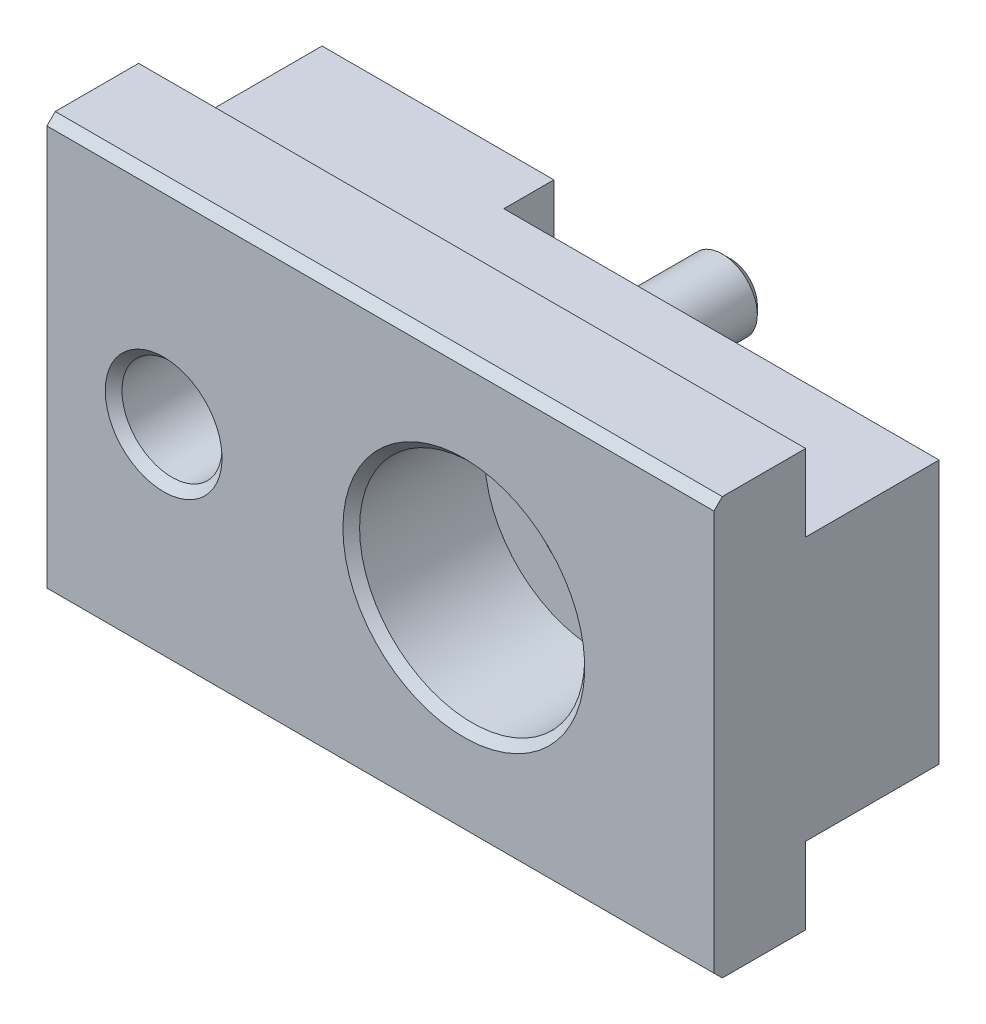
ISO-10303-21;
HEADER;
FILE_DESCRIPTION(('STEP AP214'),'2;1');
FILE_NAME('part.step','',(''),(''),'','','');
FILE_SCHEMA(('AUTOMOTIVE_DESIGN { 1 0 10303 214 1 1 1 1 }'));
ENDSEC;
DATA;
#1=APPLICATION_CONTEXT('core data for automotive mechanical design processes');
#2=APPLICATION_PROTOCOL_DEFINITION('international standard','automotive_design',2000,#1);
#3=PRODUCT_CONTEXT('',#1,'mechanical');
#4=PRODUCT('Part','Part','',(#3));
#5=PRODUCT_RELATED_PRODUCT_CATEGORY('part','',(#4));
#6=PRODUCT_DEFINITION_FORMATION('','',#4);
#7=PRODUCT_DEFINITION_CONTEXT('part definition',#1,'design');
#8=PRODUCT_DEFINITION('design','',#6,#7);
#9=PRODUCT_DEFINITION_SHAPE('','',#8);
#10=(LENGTH_UNIT() NAMED_UNIT(*) SI_UNIT(.MILLI.,.METRE.));
#11=(NAMED_UNIT(*) PLANE_ANGLE_UNIT() SI_UNIT($,.RADIAN.));
#12=(NAMED_UNIT(*) SI_UNIT($,.STERADIAN.) SOLID_ANGLE_UNIT());
#13=UNCERTAINTY_MEASURE_WITH_UNIT(LENGTH_MEASURE(1.E-05),#10,'distance_accuracy_value','');
#14=(GEOMETRIC_REPRESENTATION_CONTEXT(3) GLOBAL_UNCERTAINTY_ASSIGNED_CONTEXT((#13)) GLOBAL_UNIT_ASSIGNED_CONTEXT((#10,
#11,#12)) REPRESENTATION_CONTEXT('',''));
#15=CARTESIAN_POINT('',(0.,0.,0.));
#16=DIRECTION('',(0.,0.,1.));
#17=DIRECTION('',(1.,0.,0.));
#18=AXIS2_PLACEMENT_3D('',#15,#16,#17);
#19=CARTESIAN_POINT('',(18.,0.,5.5));
#20=DIRECTION('',(0.,0.,-1.));
#21=DIRECTION('',(-1.,0.,0.));
#22=AXIS2_PLACEMENT_3D('',#19,#20,#21);
#23=CYLINDRICAL_SURFACE('',#22,4.1);
#24=CARTESIAN_POINT('',(18.,0.,-7.5));
#25=DIRECTION('',(0.,0.,1.));
#26=DIRECTION('',(1.,0.,0.));
#27=AXIS2_PLACEMENT_3D('',#24,#25,#26);
#28=CIRCLE('',#27,4.1);
#29=CARTESIAN_POINT('',(22.1,0.,-7.5));
#30=VERTEX_POINT('',#29);
#31=EDGE_CURVE('E222',#30,#30,#28,.F.);
#32=ORIENTED_EDGE('',*,*,#31,.T.);
#33=EDGE_LOOP('',(#32));
#34=FACE_BOUND('',#33,.T.);
#35=CARTESIAN_POINT('',(18.,0.,-2.5));
#36=DIRECTION('',(0.,0.,1.));
#37=DIRECTION('',(1.,0.,0.));
#38=AXIS2_PLACEMENT_3D('',#35,#36,#37);
#39=CIRCLE('',#38,4.1);
#40=CARTESIAN_POINT('',(22.1,0.,-2.5));
#41=VERTEX_POINT('',#40);
#42=EDGE_CURVE('E150',#41,#41,#39,.F.);
#43=ORIENTED_EDGE('',*,*,#42,.F.);
#44=EDGE_LOOP('',(#43));
#45=FACE_BOUND('',#44,.T.);
#46=ADVANCED_FACE('F14',(#34,#45),#23,.F.);
#47=CARTESIAN_POINT('',(7.,-7.95,-11.));
#48=DIRECTION('',(0.,0.,1.));
#49=DIRECTION('',(1.,0.,0.));
#50=AXIS2_PLACEMENT_3D('',#47,#48,#49);
#51=PLANE('',#50);
#52=CARTESIAN_POINT('',(0.,0.,-11.));
#53=DIRECTION('',(0.,0.,1.));
#54=DIRECTION('',(1.,0.,0.));
#55=AXIS2_PLACEMENT_3D('',#52,#53,#54);
#56=CIRCLE('',#55,3.5);
#57=CARTESIAN_POINT('',(3.5,0.,-11.));
#58=VERTEX_POINT('',#57);
#59=EDGE_CURVE('E219',#58,#58,#56,.T.);
#60=ORIENTED_EDGE('',*,*,#59,.T.);
#61=EDGE_LOOP('',(#60));
#62=FACE_BOUND('',#61,.T.);
#63=DIRECTION('',(0.,-1.,0.));
#64=VECTOR('',#63,1.);
#65=CARTESIAN_POINT('',(6.9,-7.95,-11.));
#66=LINE('',#65,#64);
#67=CARTESIAN_POINT('',(6.9,7.9,-11.));
#68=VERTEX_POINT('',#67);
#69=CARTESIAN_POINT('',(6.9,-7.9,-11.));
#70=VERTEX_POINT('',#69);
#71=EDGE_CURVE('E152',#68,#70,#66,.T.);
#72=ORIENTED_EDGE('',*,*,#71,.T.);
#73=DIRECTION('',(-1.,0.,0.));
#74=VECTOR('',#73,1.);
#75=CARTESIAN_POINT('',(7.,-7.9,-11.));
#76=LINE('',#75,#74);
#77=CARTESIAN_POINT('',(-7.,-7.9,-11.));
#78=VERTEX_POINT('',#77);
#79=EDGE_CURVE('E29',#70,#78,#76,.T.);
#80=ORIENTED_EDGE('',*,*,#79,.T.);
#81=DIRECTION('',(0.,-1.,0.));
#82=VECTOR('',#81,1.);
#83=CARTESIAN_POINT('',(-7.,-7.95,-11.));
#84=LINE('',#83,#82);
#85=CARTESIAN_POINT('',(-7.,7.9,-11.));
#86=VERTEX_POINT('',#85);
#87=EDGE_CURVE('E115',#86,#78,#84,.T.);
#88=ORIENTED_EDGE('',*,*,#87,.F.);
#89=DIRECTION('',(1.,0.,0.));
#90=VECTOR('',#89,1.);
#91=CARTESIAN_POINT('',(7.,7.9,-11.));
#92=LINE('',#91,#90);
#93=EDGE_CURVE('E144',#86,#68,#92,.T.);
#94=ORIENTED_EDGE('',*,*,#93,.T.);
#95=EDGE_LOOP('',(#72,#80,#88,#94));
#96=FACE_BOUND('',#95,.T.);
#97=ADVANCED_FACE('F244',(#62,#96),#51,.F.);
#98=CARTESIAN_POINT('',(7.,12.5,0.));
#99=DIRECTION('',(0.,-1.,0.));
#100=DIRECTION('',(1.,0.,0.));
#101=AXIS2_PLACEMENT_3D('',#98,#99,#100);
#102=PLANE('',#101);
#103=DIRECTION('',(1.,0.,0.));
#104=VECTOR('',#103,1.);
#105=CARTESIAN_POINT('',(7.,12.5,5.));
#106=LINE('',#105,#104);
#107=CARTESIAN_POINT('',(-7.,12.5,5.));
#108=VERTEX_POINT('',#107);
#109=CARTESIAN_POINT('',(33.,12.5,5.));
#110=VERTEX_POINT('',#109);
#111=EDGE_CURVE('E182',#108,#110,#106,.T.);
#112=ORIENTED_EDGE('',*,*,#111,.T.);
#113=DIRECTION('',(0.,0.,1.));
#114=VECTOR('',#113,1.);
#115=CARTESIAN_POINT('',(33.,12.5,-11.));
#116=LINE('',#115,#114);
#117=CARTESIAN_POINT('',(33.,12.5,0.));
#118=VERTEX_POINT('',#117);
#119=EDGE_CURVE('E180',#118,#110,#116,.T.);
#120=ORIENTED_EDGE('',*,*,#119,.F.);
#121=DIRECTION('',(1.,0.,0.));
#122=VECTOR('',#121,1.);
#123=CARTESIAN_POINT('',(7.,12.5,0.));
#124=LINE('',#123,#122);
#125=CARTESIAN_POINT('',(-7.,12.5,0.));
#126=VERTEX_POINT('',#125);
#127=EDGE_CURVE('E199',#118,#126,#124,.F.);
#128=ORIENTED_EDGE('',*,*,#127,.T.);
#129=DIRECTION('',(0.,0.,1.));
#130=VECTOR('',#129,1.);
#131=CARTESIAN_POINT('',(-7.,12.5,-11.));
#132=LINE('',#131,#130);
#133=EDGE_CURVE('E194',#108,#126,#132,.F.);
#134=ORIENTED_EDGE('',*,*,#133,.F.);
#135=EDGE_LOOP('',(#112,#120,#128,#134));
#136=FACE_BOUND('',#135,.T.);
#137=ADVANCED_FACE('F246',(#136),#102,.F.);
#138=CARTESIAN_POINT('',(7.,-12.5,0.));
#139=DIRECTION('',(0.,1.,0.));
#140=DIRECTION('',(-1.,0.,0.));
#141=AXIS2_PLACEMENT_3D('',#138,#139,#140);
#142=PLANE('',#141);
#143=DIRECTION('',(1.,0.,0.));
#144=VECTOR('',#143,1.);
#145=CARTESIAN_POINT('',(7.,-12.5,5.));
#146=LINE('',#145,#144);
#147=CARTESIAN_POINT('',(33.,-12.5,5.));
#148=VERTEX_POINT('',#147);
#149=CARTESIAN_POINT('',(-7.,-12.5,5.));
#150=VERTEX_POINT('',#149);
#151=EDGE_CURVE('E196',#148,#150,#146,.F.);
#152=ORIENTED_EDGE('',*,*,#151,.T.);
#153=DIRECTION('',(0.,0.,1.));
#154=VECTOR('',#153,1.);
#155=CARTESIAN_POINT('',(-7.,-12.5,-11.));
#156=LINE('',#155,#154);
#157=CARTESIAN_POINT('',(-7.,-12.5,0.));
#158=VERTEX_POINT('',#157);
#159=EDGE_CURVE('E114',#158,#150,#156,.T.);
#160=ORIENTED_EDGE('',*,*,#159,.F.);
#161=DIRECTION('',(1.,0.,0.));
#162=VECTOR('',#161,1.);
#163=CARTESIAN_POINT('',(7.,-12.5,0.));
#164=LINE('',#163,#162);
#165=CARTESIAN_POINT('',(33.,-12.5,0.));
#166=VERTEX_POINT('',#165);
#167=EDGE_CURVE('E110',#158,#166,#164,.T.);
#168=ORIENTED_EDGE('',*,*,#167,.T.);
#169=DIRECTION('',(0.,0.,1.));
#170=VECTOR('',#169,1.);
#171=CARTESIAN_POINT('',(33.,-12.5,-11.));
#172=LINE('',#171,#170);
#173=EDGE_CURVE('E173',#148,#166,#172,.F.);
#174=ORIENTED_EDGE('',*,*,#173,.F.);
#175=EDGE_LOOP('',(#152,#160,#168,#174));
#176=FACE_BOUND('',#175,.T.);
#177=ADVANCED_FACE('F256',(#176),#142,.F.);
#178=CARTESIAN_POINT('',(7.,-12.5,0.));
#179=DIRECTION('',(0.,0.,1.));
#180=DIRECTION('',(1.,0.,0.));
#181=AXIS2_PLACEMENT_3D('',#178,#179,#180);
#182=PLANE('',#181);
#183=ORIENTED_EDGE('',*,*,#167,.F.);
#184=DIRECTION('',(0.,-1.,0.));
#185=VECTOR('',#184,1.);
#186=CARTESIAN_POINT('',(-7.,-7.95,0.));
#187=LINE('',#186,#185);
#188=CARTESIAN_POINT('',(-7.,-7.9,0.));
#189=VERTEX_POINT('',#188);
#190=EDGE_CURVE('E104',#189,#158,#187,.T.);
#191=ORIENTED_EDGE('',*,*,#190,.F.);
#192=DIRECTION('',(-1.,0.,0.));
#193=VECTOR('',#192,1.);
#194=CARTESIAN_POINT('',(46.058386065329,-7.9,0.));
#195=LINE('',#194,#193);
#196=CARTESIAN_POINT('',(33.,-7.9,0.));
#197=VERTEX_POINT('',#196);
#198=EDGE_CURVE('E108',#197,#189,#195,.T.);
#199=ORIENTED_EDGE('',*,*,#198,.F.);
#200=DIRECTION('',(0.,1.,0.));
#201=VECTOR('',#200,1.);
#202=CARTESIAN_POINT('',(33.,-7.95,0.));
#203=LINE('',#202,#201);
#204=EDGE_CURVE('E171',#166,#197,#203,.T.);
#205=ORIENTED_EDGE('',*,*,#204,.F.);
#206=EDGE_LOOP('',(#183,#191,#199,#205));
#207=FACE_BOUND('',#206,.T.);
#208=ADVANCED_FACE('F106',(#207),#182,.F.);
#209=CARTESIAN_POINT('',(33.,-7.95,-8.));
#210=DIRECTION('',(0.,0.,1.));
#211=DIRECTION('',(1.,0.,0.));
#212=AXIS2_PLACEMENT_3D('',#209,#210,#211);
#213=PLANE('',#212);
#214=CARTESIAN_POINT('',(18.,0.,-8.));
#215=DIRECTION('',(0.,0.,1.));
#216=DIRECTION('',(1.,0.,0.));
#217=AXIS2_PLACEMENT_3D('',#214,#215,#216);
#218=CIRCLE('',#217,4.6);
#219=CARTESIAN_POINT('',(22.6,0.,-8.));
#220=VERTEX_POINT('',#219);
#221=EDGE_CURVE('E225',#220,#220,#218,.T.);
#222=ORIENTED_EDGE('',*,*,#221,.T.);
#223=EDGE_LOOP('',(#222));
#224=FACE_BOUND('',#223,.T.);
#225=CARTESIAN_POINT('',(10.,0.,-8.));
#226=DIRECTION('',(0.,0.,1.));
#227=DIRECTION('',(1.,0.,0.));
#228=AXIS2_PLACEMENT_3D('',#225,#226,#227);
#229=CIRCLE('',#228,2.1);
#230=CARTESIAN_POINT('',(12.1,0.,-8.));
#231=VERTEX_POINT('',#230);
#232=EDGE_CURVE('E157',#231,#231,#229,.F.);
#233=ORIENTED_EDGE('',*,*,#232,.F.);
#234=EDGE_LOOP('',(#233));
#235=FACE_BOUND('',#234,.T.);
#236=DIRECTION('',(0.,1.,0.));
#237=VECTOR('',#236,1.);
#238=CARTESIAN_POINT('',(33.,-7.95,-8.));
#239=LINE('',#238,#237);
#240=CARTESIAN_POINT('',(33.,-7.9,-8.));
#241=VERTEX_POINT('',#240);
#242=CARTESIAN_POINT('',(33.,7.9,-8.));
#243=VERTEX_POINT('',#242);
#244=EDGE_CURVE('E169',#241,#243,#239,.T.);
#245=ORIENTED_EDGE('',*,*,#244,.F.);
#246=DIRECTION('',(-1.,0.,0.));
#247=VECTOR('',#246,1.);
#248=CARTESIAN_POINT('',(33.,-7.9,-8.));
#249=LINE('',#248,#247);
#250=CARTESIAN_POINT('',(6.9,-7.9,-8.));
#251=VERTEX_POINT('',#250);
#252=EDGE_CURVE('E122',#241,#251,#249,.T.);
#253=ORIENTED_EDGE('',*,*,#252,.T.);
#254=DIRECTION('',(0.,1.,0.));
#255=VECTOR('',#254,1.);
#256=CARTESIAN_POINT('',(6.9,-17.6703763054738,-8.));
#257=LINE('',#256,#255);
#258=CARTESIAN_POINT('',(6.9,7.9,-8.));
#259=VERTEX_POINT('',#258);
#260=EDGE_CURVE('E36',#251,#259,#257,.T.);
#261=ORIENTED_EDGE('',*,*,#260,.T.);
#262=DIRECTION('',(1.,0.,0.));
#263=VECTOR('',#262,1.);
#264=CARTESIAN_POINT('',(33.,7.9,-8.));
#265=LINE('',#264,#263);
#266=EDGE_CURVE('E142',#259,#243,#265,.T.);
#267=ORIENTED_EDGE('',*,*,#266,.T.);
#268=EDGE_LOOP('',(#245,#253,#261,#267));
#269=FACE_BOUND('',#268,.T.);
#270=ADVANCED_FACE('F295',(#224,#235,#269),#213,.F.);
#271=CARTESIAN_POINT('',(7.,7.95,0.));
#272=DIRECTION('',(0.,0.,1.));
#273=DIRECTION('',(1.,0.,0.));
#274=AXIS2_PLACEMENT_3D('',#271,#272,#273);
#275=PLANE('',#274);
#276=ORIENTED_EDGE('',*,*,#127,.F.);
#277=DIRECTION('',(0.,1.,0.));
#278=VECTOR('',#277,1.);
#279=CARTESIAN_POINT('',(33.,-7.95,0.));
#280=LINE('',#279,#278);
#281=CARTESIAN_POINT('',(33.,7.9,0.));
#282=VERTEX_POINT('',#281);
#283=EDGE_CURVE('E167',#282,#118,#280,.T.);
#284=ORIENTED_EDGE('',*,*,#283,.F.);
#285=DIRECTION('',(-1.,0.,0.));
#286=VECTOR('',#285,1.);
#287=CARTESIAN_POINT('',(46.058386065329,7.9,0.));
#288=LINE('',#287,#286);
#289=CARTESIAN_POINT('',(-7.,7.9,0.));
#290=VERTEX_POINT('',#289);
#291=EDGE_CURVE('E139',#282,#290,#288,.T.);
#292=ORIENTED_EDGE('',*,*,#291,.T.);
#293=DIRECTION('',(0.,-1.,0.));
#294=VECTOR('',#293,1.);
#295=CARTESIAN_POINT('',(-7.,-7.95,0.));
#296=LINE('',#295,#294);
#297=EDGE_CURVE('E192',#126,#290,#296,.T.);
#298=ORIENTED_EDGE('',*,*,#297,.F.);
#299=EDGE_LOOP('',(#276,#284,#292,#298));
#300=FACE_BOUND('',#299,.T.);
#301=ADVANCED_FACE('F291',(#300),#275,.F.);
#302=CARTESIAN_POINT('',(7.,-12.5,5.));
#303=DIRECTION('',(0.,0.707106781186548,-0.707106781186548));
#304=DIRECTION('',(0.,0.707106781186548,0.707106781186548));
#305=AXIS2_PLACEMENT_3D('',#302,#303,#304);
#306=PLANE('',#305);
#307=DIRECTION('',(-1.,0.,0.));
#308=VECTOR('',#307,1.);
#309=CARTESIAN_POINT('',(7.,-12.,5.5));
#310=LINE('',#309,#308);
#311=CARTESIAN_POINT('',(33.,-12.,5.5));
#312=VERTEX_POINT('',#311);
#313=CARTESIAN_POINT('',(-7.,-12.,5.5));
#314=VERTEX_POINT('',#313);
#315=EDGE_CURVE('E164',#312,#314,#310,.T.);
#316=ORIENTED_EDGE('',*,*,#315,.T.);
#317=DIRECTION('',(0.,0.707106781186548,0.707106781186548));
#318=VECTOR('',#317,1.);
#319=CARTESIAN_POINT('',(-7.,-12.5,5.));
#320=LINE('',#319,#318);
#321=EDGE_CURVE('E188',#150,#314,#320,.T.);
#322=ORIENTED_EDGE('',*,*,#321,.F.);
#323=ORIENTED_EDGE('',*,*,#151,.F.);
#324=DIRECTION('',(0.,-0.707106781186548,-0.707106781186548));
#325=VECTOR('',#324,1.);
#326=CARTESIAN_POINT('',(33.,-12.,5.5));
#327=LINE('',#326,#325);
#328=EDGE_CURVE('E175',#312,#148,#327,.T.);
#329=ORIENTED_EDGE('',*,*,#328,.F.);
#330=EDGE_LOOP('',(#316,#322,#323,#329));
#331=FACE_BOUND('',#330,.T.);
#332=ADVANCED_FACE('F288',(#331),#306,.F.);
#333=CARTESIAN_POINT('',(-7.,-7.95,-11.));
#334=DIRECTION('',(-1.,0.,0.));
#335=DIRECTION('',(0.,-1.,0.));
#336=AXIS2_PLACEMENT_3D('',#333,#334,#335);
#337=PLANE('',#336);
#338=DIRECTION('',(0.,0.,-1.));
#339=VECTOR('',#338,1.);
#340=CARTESIAN_POINT('',(-7.,-7.9,0.));
#341=LINE('',#340,#339);
#342=EDGE_CURVE('E119',#189,#78,#341,.T.);
#343=ORIENTED_EDGE('',*,*,#342,.F.);
#344=ORIENTED_EDGE('',*,*,#190,.T.);
#345=ORIENTED_EDGE('',*,*,#159,.T.);
#346=ORIENTED_EDGE('',*,*,#321,.T.);
#347=DIRECTION('',(0.,1.,0.));
#348=VECTOR('',#347,1.);
#349=CARTESIAN_POINT('',(-7.,-12.5,5.5));
#350=LINE('',#349,#348);
#351=CARTESIAN_POINT('',(-7.,12.,5.5));
#352=VERTEX_POINT('',#351);
#353=EDGE_CURVE('E161',#314,#352,#350,.T.);
#354=ORIENTED_EDGE('',*,*,#353,.T.);
#355=DIRECTION('',(0.,0.707106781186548,-0.707106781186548));
#356=VECTOR('',#355,1.);
#357=CARTESIAN_POINT('',(-7.,12.,5.5));
#358=LINE('',#357,#356);
#359=EDGE_CURVE('E185',#352,#108,#358,.T.);
#360=ORIENTED_EDGE('',*,*,#359,.T.);
#361=ORIENTED_EDGE('',*,*,#133,.T.);
#362=ORIENTED_EDGE('',*,*,#297,.T.);
#363=DIRECTION('',(0.,0.,1.));
#364=VECTOR('',#363,1.);
#365=CARTESIAN_POINT('',(-7.,7.9,0.));
#366=LINE('',#365,#364);
#367=EDGE_CURVE('E133',#86,#290,#366,.T.);
#368=ORIENTED_EDGE('',*,*,#367,.F.);
#369=ORIENTED_EDGE('',*,*,#87,.T.);
#370=EDGE_LOOP('',(#343,#344,#345,#346,#354,#360,#361,#362,#368,#369));
#371=FACE_BOUND('',#370,.T.);
#372=ADVANCED_FACE('F125',(#371),#337,.T.);
#373=CARTESIAN_POINT('',(7.,12.,5.5));
#374=DIRECTION('',(0.,-0.707106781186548,-0.707106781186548));
#375=DIRECTION('',(0.,0.707106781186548,-0.707106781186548));
#376=AXIS2_PLACEMENT_3D('',#373,#374,#375);
#377=PLANE('',#376);
#378=ORIENTED_EDGE('',*,*,#111,.F.);
#379=ORIENTED_EDGE('',*,*,#359,.F.);
#380=DIRECTION('',(-1.,0.,0.));
#381=VECTOR('',#380,1.);
#382=CARTESIAN_POINT('',(7.,12.,5.5));
#383=LINE('',#382,#381);
#384=CARTESIAN_POINT('',(33.,12.,5.5));
#385=VERTEX_POINT('',#384);
#386=EDGE_CURVE('E158',#352,#385,#383,.F.);
#387=ORIENTED_EDGE('',*,*,#386,.T.);
#388=DIRECTION('',(0.,-0.707106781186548,0.707106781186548));
#389=VECTOR('',#388,1.);
#390=CARTESIAN_POINT('',(33.,12.5,5.));
#391=LINE('',#390,#389);
#392=EDGE_CURVE('E178',#110,#385,#391,.T.);
#393=ORIENTED_EDGE('',*,*,#392,.F.);
#394=EDGE_LOOP('',(#378,#379,#387,#393));
#395=FACE_BOUND('',#394,.T.);
#396=ADVANCED_FACE('F281',(#395),#377,.F.);
#397=CARTESIAN_POINT('',(33.,-7.95,-11.));
#398=DIRECTION('',(1.,0.,0.));
#399=DIRECTION('',(0.,1.,0.));
#400=AXIS2_PLACEMENT_3D('',#397,#398,#399);
#401=PLANE('',#400);
#402=DIRECTION('',(0.,0.,-1.));
#403=VECTOR('',#402,1.);
#404=CARTESIAN_POINT('',(33.,-7.9,0.));
#405=LINE('',#404,#403);
#406=EDGE_CURVE('E121',#197,#241,#405,.T.);
#407=ORIENTED_EDGE('',*,*,#406,.T.);
#408=ORIENTED_EDGE('',*,*,#244,.T.);
#409=DIRECTION('',(0.,0.,1.));
#410=VECTOR('',#409,1.);
#411=CARTESIAN_POINT('',(33.,7.9,0.));
#412=LINE('',#411,#410);
#413=EDGE_CURVE('E136',#243,#282,#412,.T.);
#414=ORIENTED_EDGE('',*,*,#413,.T.);
#415=ORIENTED_EDGE('',*,*,#283,.T.);
#416=ORIENTED_EDGE('',*,*,#119,.T.);
#417=ORIENTED_EDGE('',*,*,#392,.T.);
#418=DIRECTION('',(0.,1.,0.));
#419=VECTOR('',#418,1.);
#420=CARTESIAN_POINT('',(33.,-12.5,5.5));
#421=LINE('',#420,#419);
#422=EDGE_CURVE('E155',#385,#312,#421,.F.);
#423=ORIENTED_EDGE('',*,*,#422,.T.);
#424=ORIENTED_EDGE('',*,*,#328,.T.);
#425=ORIENTED_EDGE('',*,*,#173,.T.);
#426=ORIENTED_EDGE('',*,*,#204,.T.);
#427=EDGE_LOOP('',(#407,#408,#414,#415,#416,#417,#423,#424,#425,#426));
#428=FACE_BOUND('',#427,.T.);
#429=ADVANCED_FACE('F273',(#428),#401,.T.);
#430=CARTESIAN_POINT('',(7.,-12.5,5.5));
#431=DIRECTION('',(0.,0.,-1.));
#432=DIRECTION('',(-1.,0.,0.));
#433=AXIS2_PLACEMENT_3D('',#430,#431,#432);
#434=PLANE('',#433);
#435=CARTESIAN_POINT('',(0.,0.,5.5));
#436=DIRECTION('',(0.,0.,-1.));
#437=DIRECTION('',(-1.,0.,0.));
#438=AXIS2_PLACEMENT_3D('',#435,#436,#437);
#439=CIRCLE('',#438,3.5);
#440=CARTESIAN_POINT('',(-3.5,0.,5.5));
#441=VERTEX_POINT('',#440);
#442=EDGE_CURVE('E231',#441,#441,#439,.T.);
#443=ORIENTED_EDGE('',*,*,#442,.T.);
#444=EDGE_LOOP('',(#443));
#445=FACE_BOUND('',#444,.T.);
#446=CARTESIAN_POINT('',(18.,0.,5.5));
#447=DIRECTION('',(0.,0.,-1.));
#448=DIRECTION('',(-1.,0.,0.));
#449=AXIS2_PLACEMENT_3D('',#446,#447,#448);
#450=CIRCLE('',#449,7.25);
#451=CARTESIAN_POINT('',(10.75,0.,5.5));
#452=VERTEX_POINT('',#451);
#453=EDGE_CURVE('E228',#452,#452,#450,.T.);
#454=ORIENTED_EDGE('',*,*,#453,.T.);
#455=EDGE_LOOP('',(#454));
#456=FACE_BOUND('',#455,.T.);
#457=ORIENTED_EDGE('',*,*,#315,.F.);
#458=ORIENTED_EDGE('',*,*,#422,.F.);
#459=ORIENTED_EDGE('',*,*,#386,.F.);
#460=ORIENTED_EDGE('',*,*,#353,.F.);
#461=EDGE_LOOP('',(#457,#458,#459,#460));
#462=FACE_BOUND('',#461,.T.);
#463=ADVANCED_FACE('F261',(#445,#456,#462),#434,.F.);
#464=CARTESIAN_POINT('',(0.,0.,20.6251982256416));
#465=DIRECTION('',(0.,0.,-1.));
#466=DIRECTION('',(-1.,0.,0.));
#467=AXIS2_PLACEMENT_3D('',#464,#465,#466);
#468=CYLINDRICAL_SURFACE('',#467,3.);
#469=CARTESIAN_POINT('',(0.,0.,-10.5));
#470=DIRECTION('',(0.,0.,1.));
#471=DIRECTION('',(1.,0.,0.));
#472=AXIS2_PLACEMENT_3D('',#469,#470,#471);
#473=CIRCLE('',#472,3.);
#474=CARTESIAN_POINT('',(3.,0.,-10.5));
#475=VERTEX_POINT('',#474);
#476=EDGE_CURVE('E216',#475,#475,#473,.F.);
#477=ORIENTED_EDGE('',*,*,#476,.T.);
#478=EDGE_LOOP('',(#477));
#479=FACE_BOUND('',#478,.T.);
#480=CARTESIAN_POINT('',(0.,0.,5.));
#481=DIRECTION('',(0.,0.,-1.));
#482=DIRECTION('',(-1.,0.,0.));
#483=AXIS2_PLACEMENT_3D('',#480,#481,#482);
#484=CIRCLE('',#483,3.);
#485=CARTESIAN_POINT('',(-3.,0.,5.));
#486=VERTEX_POINT('',#485);
#487=EDGE_CURVE('E213',#486,#486,#484,.F.);
#488=ORIENTED_EDGE('',*,*,#487,.T.);
#489=EDGE_LOOP('',(#488));
#490=FACE_BOUND('',#489,.T.);
#491=ADVANCED_FACE('F249',(#479,#490),#468,.F.);
#492=CARTESIAN_POINT('',(6.9,-17.6703763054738,27.7451052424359));
#493=DIRECTION('',(-1.,0.,0.));
#494=DIRECTION('',(0.,-1.,0.));
#495=AXIS2_PLACEMENT_3D('',#492,#493,#494);
#496=PLANE('',#495);
#497=ORIENTED_EDGE('',*,*,#260,.F.);
#498=DIRECTION('',(0.,0.,-1.));
#499=VECTOR('',#498,1.);
#500=CARTESIAN_POINT('',(6.9,-7.9,27.7451052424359));
#501=LINE('',#500,#499);
#502=EDGE_CURVE('E9',#251,#70,#501,.T.);
#503=ORIENTED_EDGE('',*,*,#502,.T.);
#504=ORIENTED_EDGE('',*,*,#71,.F.);
#505=DIRECTION('',(0.,0.,1.));
#506=VECTOR('',#505,1.);
#507=CARTESIAN_POINT('',(6.9,7.9,27.7451052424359));
#508=LINE('',#507,#506);
#509=EDGE_CURVE('E22',#68,#259,#508,.T.);
#510=ORIENTED_EDGE('',*,*,#509,.T.);
#511=EDGE_LOOP('',(#497,#503,#504,#510));
#512=FACE_BOUND('',#511,.T.);
#513=ADVANCED_FACE('F239',(#512),#496,.F.);
#514=CARTESIAN_POINT('',(10.,0.,-18.5));
#515=DIRECTION('',(0.,0.,1.));
#516=DIRECTION('',(1.,0.,0.));
#517=AXIS2_PLACEMENT_3D('',#514,#515,#516);
#518=CYLINDRICAL_SURFACE('',#517,2.1);
#519=CARTESIAN_POINT('',(10.,0.,-18.));
#520=DIRECTION('',(0.,0.,-1.));
#521=DIRECTION('',(-1.,0.,0.));
#522=AXIS2_PLACEMENT_3D('',#519,#520,#521);
#523=CIRCLE('',#522,2.1);
#524=CARTESIAN_POINT('',(7.9,0.,-18.));
#525=VERTEX_POINT('',#524);
#526=EDGE_CURVE('E210',#525,#525,#523,.F.);
#527=ORIENTED_EDGE('',*,*,#526,.T.);
#528=EDGE_LOOP('',(#527));
#529=FACE_BOUND('',#528,.T.);
#530=ORIENTED_EDGE('',*,*,#232,.T.);
#531=EDGE_LOOP('',(#530));
#532=FACE_BOUND('',#531,.T.);
#533=ADVANCED_FACE('F271',(#529,#532),#518,.T.);
#534=CARTESIAN_POINT('',(10.,0.,-18.5));
#535=DIRECTION('',(0.,0.,-1.));
#536=DIRECTION('',(-1.,0.,0.));
#537=AXIS2_PLACEMENT_3D('',#534,#535,#536);
#538=PLANE('',#537);
#539=CARTESIAN_POINT('',(10.,0.,-18.5));
#540=DIRECTION('',(0.,0.,-1.));
#541=DIRECTION('',(-1.,0.,0.));
#542=AXIS2_PLACEMENT_3D('',#539,#540,#541);
#543=CIRCLE('',#542,1.60000000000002);
#544=CARTESIAN_POINT('',(8.39999999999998,0.,-18.5));
#545=VERTEX_POINT('',#544);
#546=EDGE_CURVE('E205',#545,#545,#543,.T.);
#547=ORIENTED_EDGE('',*,*,#546,.T.);
#548=EDGE_LOOP('',(#547));
#549=FACE_BOUND('',#548,.T.);
#550=ADVANCED_FACE('F388',(#549),#538,.T.);
#551=CARTESIAN_POINT('',(18.,0.,-2.5));
#552=DIRECTION('',(0.,0.,1.));
#553=DIRECTION('',(1.,0.,0.));
#554=AXIS2_PLACEMENT_3D('',#551,#552,#553);
#555=PLANE('',#554);
#556=CARTESIAN_POINT('',(18.,0.,-2.5));
#557=DIRECTION('',(0.,0.,1.));
#558=DIRECTION('',(1.,0.,0.));
#559=AXIS2_PLACEMENT_3D('',#556,#557,#558);
#560=CIRCLE('',#559,6.75);
#561=CARTESIAN_POINT('',(24.75,0.,-2.5));
#562=VERTEX_POINT('',#561);
#563=EDGE_CURVE('E147',#562,#562,#560,.T.);
#564=ORIENTED_EDGE('',*,*,#563,.T.);
#565=EDGE_LOOP('',(#564));
#566=FACE_BOUND('',#565,.T.);
#567=ORIENTED_EDGE('',*,*,#42,.T.);
#568=EDGE_LOOP('',(#567));
#569=FACE_BOUND('',#568,.T.);
#570=ADVANCED_FACE('F398',(#566,#569),#555,.T.);
#571=CARTESIAN_POINT('',(18.,0.,-2.5));
#572=DIRECTION('',(0.,0.,1.));
#573=DIRECTION('',(1.,0.,0.));
#574=AXIS2_PLACEMENT_3D('',#571,#572,#573);
#575=CYLINDRICAL_SURFACE('',#574,6.75);
#576=CARTESIAN_POINT('',(18.,0.,5.));
#577=DIRECTION('',(0.,0.,-1.));
#578=DIRECTION('',(-1.,0.,0.));
#579=AXIS2_PLACEMENT_3D('',#576,#577,#578);
#580=CIRCLE('',#579,6.75);
#581=CARTESIAN_POINT('',(11.25,0.,5.));
#582=VERTEX_POINT('',#581);
#583=EDGE_CURVE('E234',#582,#582,#580,.F.);
#584=ORIENTED_EDGE('',*,*,#583,.T.);
#585=EDGE_LOOP('',(#584));
#586=FACE_BOUND('',#585,.T.);
#587=ORIENTED_EDGE('',*,*,#563,.F.);
#588=EDGE_LOOP('',(#587));
#589=FACE_BOUND('',#588,.T.);
#590=ADVANCED_FACE('F409',(#586,#589),#575,.F.);
#591=CARTESIAN_POINT('',(10.,0.,-18.5));
#592=DIRECTION('',(0.,0.,1.));
#593=DIRECTION('',(1.,0.,0.));
#594=AXIS2_PLACEMENT_3D('',#591,#592,#593);
#595=CONICAL_SURFACE('',#594,1.60000000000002,0.785398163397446);
#596=ORIENTED_EDGE('',*,*,#526,.F.);
#597=EDGE_LOOP('',(#596));
#598=FACE_BOUND('',#597,.T.);
#599=ORIENTED_EDGE('',*,*,#546,.F.);
#600=EDGE_LOOP('',(#599));
#601=FACE_BOUND('',#600,.T.);
#602=ADVANCED_FACE('F420',(#598,#601),#595,.T.);
#603=CARTESIAN_POINT('',(0.,0.,-10.5));
#604=DIRECTION('',(0.,0.,-1.));
#605=DIRECTION('',(-1.,0.,0.));
#606=AXIS2_PLACEMENT_3D('',#603,#604,#605);
#607=CONICAL_SURFACE('',#606,3.,0.785398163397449);
#608=ORIENTED_EDGE('',*,*,#59,.F.);
#609=EDGE_LOOP('',(#608));
#610=FACE_BOUND('',#609,.T.);
#611=ORIENTED_EDGE('',*,*,#476,.F.);
#612=EDGE_LOOP('',(#611));
#613=FACE_BOUND('',#612,.T.);
#614=ADVANCED_FACE('F431',(#610,#613),#607,.F.);
#615=CARTESIAN_POINT('',(18.,0.,-7.5));
#616=DIRECTION('',(0.,0.,-1.));
#617=DIRECTION('',(-1.,0.,0.));
#618=AXIS2_PLACEMENT_3D('',#615,#616,#617);
#619=CONICAL_SURFACE('',#618,4.1,0.785398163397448);
#620=ORIENTED_EDGE('',*,*,#221,.F.);
#621=EDGE_LOOP('',(#620));
#622=FACE_BOUND('',#621,.T.);
#623=ORIENTED_EDGE('',*,*,#31,.F.);
#624=EDGE_LOOP('',(#623));
#625=FACE_BOUND('',#624,.T.);
#626=ADVANCED_FACE('F440',(#622,#625),#619,.F.);
#627=CARTESIAN_POINT('',(0.,0.,5.));
#628=DIRECTION('',(0.,0.,1.));
#629=DIRECTION('',(1.,0.,0.));
#630=AXIS2_PLACEMENT_3D('',#627,#628,#629);
#631=CONICAL_SURFACE('',#630,3.,0.785398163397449);
#632=ORIENTED_EDGE('',*,*,#442,.F.);
#633=EDGE_LOOP('',(#632));
#634=FACE_BOUND('',#633,.T.);
#635=ORIENTED_EDGE('',*,*,#487,.F.);
#636=EDGE_LOOP('',(#635));
#637=FACE_BOUND('',#636,.T.);
#638=ADVANCED_FACE('F450',(#634,#637),#631,.F.);
#639=CARTESIAN_POINT('',(18.,0.,5.));
#640=DIRECTION('',(0.,0.,1.));
#641=DIRECTION('',(1.,0.,0.));
#642=AXIS2_PLACEMENT_3D('',#639,#640,#641);
#643=CONICAL_SURFACE('',#642,6.75,0.785398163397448);
#644=ORIENTED_EDGE('',*,*,#453,.F.);
#645=EDGE_LOOP('',(#644));
#646=FACE_BOUND('',#645,.T.);
#647=ORIENTED_EDGE('',*,*,#583,.F.);
#648=EDGE_LOOP('',(#647));
#649=FACE_BOUND('',#648,.T.);
#650=ADVANCED_FACE('F16',(#646,#649),#643,.F.);
#651=CARTESIAN_POINT('',(46.058386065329,7.9,0.));
#652=DIRECTION('',(0.,-1.,0.));
#653=DIRECTION('',(1.,0.,0.));
#654=AXIS2_PLACEMENT_3D('',#651,#652,#653);
#655=PLANE('',#654);
#656=ORIENTED_EDGE('',*,*,#367,.T.);
#657=ORIENTED_EDGE('',*,*,#291,.F.);
#658=ORIENTED_EDGE('',*,*,#413,.F.);
#659=ORIENTED_EDGE('',*,*,#266,.F.);
#660=ORIENTED_EDGE('',*,*,#509,.F.);
#661=ORIENTED_EDGE('',*,*,#93,.F.);
#662=EDGE_LOOP('',(#656,#657,#658,#659,#660,#661));
#663=FACE_BOUND('',#662,.T.);
#664=ADVANCED_FACE('F241',(#663),#655,.F.);
#665=CARTESIAN_POINT('',(46.058386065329,-7.9,0.));
#666=DIRECTION('',(0.,1.,0.));
#667=DIRECTION('',(-1.,0.,0.));
#668=AXIS2_PLACEMENT_3D('',#665,#666,#667);
#669=PLANE('',#668);
#670=ORIENTED_EDGE('',*,*,#502,.F.);
#671=ORIENTED_EDGE('',*,*,#252,.F.);
#672=ORIENTED_EDGE('',*,*,#406,.F.);
#673=ORIENTED_EDGE('',*,*,#198,.T.);
#674=ORIENTED_EDGE('',*,*,#342,.T.);
#675=ORIENTED_EDGE('',*,*,#79,.F.);
#676=EDGE_LOOP('',(#670,#671,#672,#673,#674,#675));
#677=FACE_BOUND('',#676,.T.);
#678=ADVANCED_FACE('F118',(#677),#669,.F.);
#679=CLOSED_SHELL('',(#46,#97,#137,#177,#208,#270,#301,#332,#372,#396,#429,#463,#491,#513,#533,
#550,#570,#590,#602,#614,#626,#638,#650,#664,#678));
#680=MANIFOLD_SOLID_BREP('B1',#679);
#681=ADVANCED_BREP_SHAPE_REPRESENTATION('',(#18,#680),#14);
#682=SHAPE_DEFINITION_REPRESENTATION(#9,#681);
ENDSEC;
END-ISO-10303-21;
